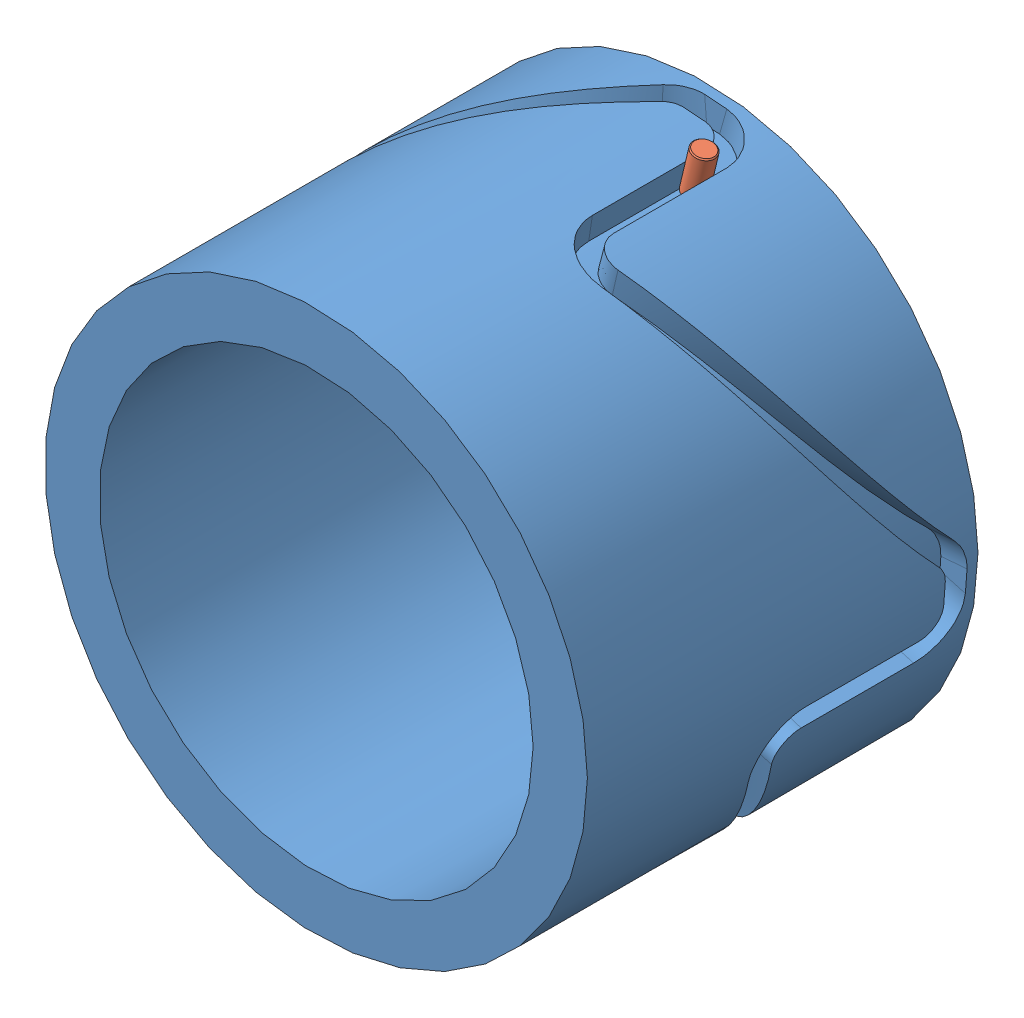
SolidWorks assembly Baugruppe1.SLDASM, configuration Standard (file format 4100). Lengths in mm.
Overall size (250 256.58 180).
2 component instances, 2 part files, 3 mates.
Components (placement in the parent):
- umwickeln1 tm-1: umwickeln1 tm.SLDPRT [Default] at origin size (250 250 180)
- BOLZEN-1: BOLZEN.SLDPRT [Standard] at (26.5424 110.9698 -147.6537) x (-0.972567 0.232624 0) z (0.232624 0.972567 0) size (10 10 20)
Mates (geometry in assembly coordinates):
- Senkrecht1: perpendicular: line of umwickeln1 tm-1 through (0 0 -180) axis (0 0 1); axis of BOLZEN-1 through (31.0786 129.9349 -147.6537) axis (-0.232624 -0.972567 0)
- Deckungsgleich3: coincident: line of umwickeln1 tm-1 through (0 0 -180) axis (0 0 1); plane of BOLZEN-1
- Deckungsgleich6: coincident: curve of umwickeln1 tm-1; point of BOLZEN-1
